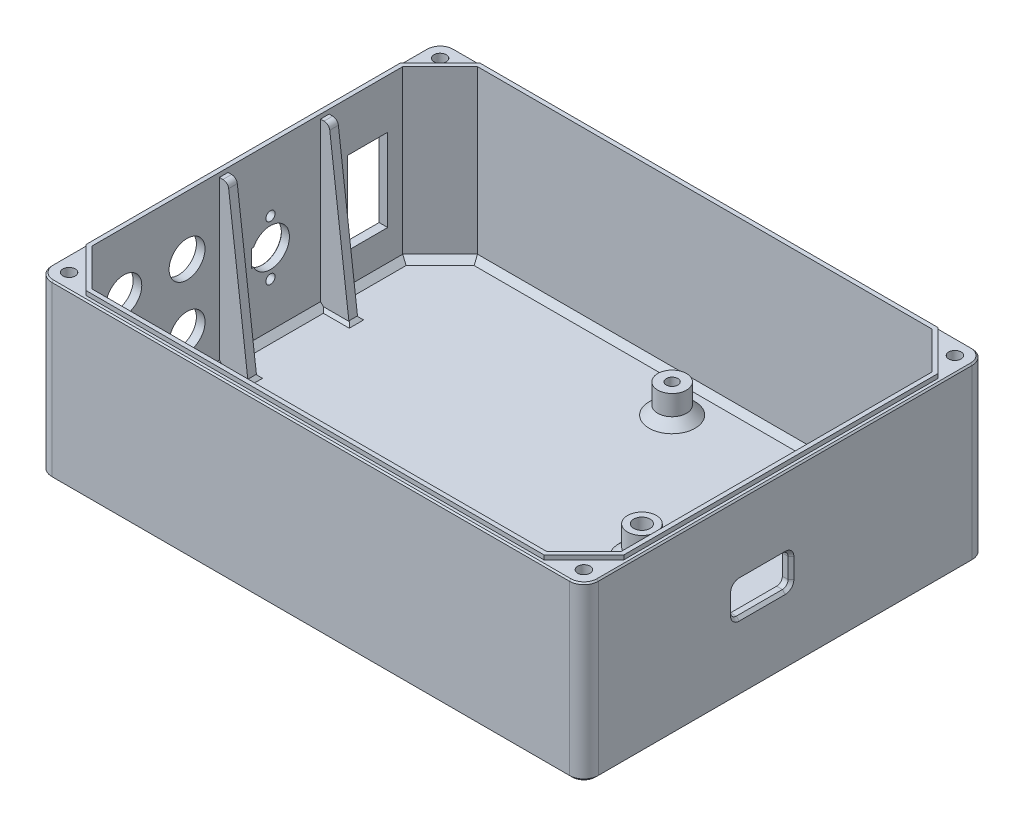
from build123d import *
from OCP.BRepFilletAPI import BRepFilletAPI_MakeChamfer

# Parameters (mm, degrees)
SKETCH2_W                      = 190
SKETCH2_H                      = 140
ENCLOSURE_BODY_DEPTH           = 60
FILLET1_R                      = 5
SHELL1_T                       = -3
SKETCH3_R                      = 5
SKETCH3_R_2                    = 2
SKETCH3_R_3                    = 2.85
PCB_SUPPORTS_DEPTH             = 10
ENCLOSURE_START                = 57
ENCLOSURE_CORNER_FLANGES_DEPTH = 57
SKETCH8_R                      = 3.8
CUT_EXTRUDE1_DEPTH             = 45.5
SKETCH9_R                      = 2.15
CUT_EXTRUDE2_DEPTH             = 127.472328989
CHAMFER1_SIZE                  = 2
USB_CUTOUT_DEPTH               = 6
SKETCH11_R                     = 1.6
SKETCH11_R_2                   = 6.25
SKETCH11_W                     = 14
SKETCH11_H                     = 28.7
BUTTON_CUTOUTS_DEPTH           = 6
CHAMFER3_SIZE                  = 1
SKETCH15_W                     = 3
SKETCH15_H                     = 12.65913529
SKETCH15_H_2                   = 57
BOSS_EXTRUDE6_DEPTH            = 10
CUT_EXTRUDE3_REACH             = 155.152
CHAMFER4_SIZE                  = 3
FILLET2_R                      = 2
BOSS_EXTRUDE7_DEPTH            = 1.5
CHAMFER5_SIZE                  = 1
CHAMFER5_SIZE2                 = 1.148564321
CHAMFER6_SIZE                  = 1
CHAMFER7_SIZE                  = 0.2
CHAMFER8_SIZE                  = 0.5


with BuildPart() as part:
    # Sketch2 → Enclosure body (new body)
    with BuildSketch(Plane(origin=(0, 0, 0), x_dir=(1, 0, 0), z_dir=(0, 1, 0))):
        Rectangle(SKETCH2_W, SKETCH2_H)
    extrude(amount=ENCLOSURE_BODY_DEPTH)

    # Fillet1
    fillet1_edges = [part.edges().sort_by_distance(p)[0] for p in [
        (95, 30, 70),
        (-95, 30, 70),
        (-95, 30, -70),
        (95, 30, -70),
    ]]
    fillet(fillet1_edges, radius=FILLET1_R)

    # Shell1
    shell1_openings = [part.faces().sort_by_distance(p)[0] for p in [
        (0, 60, 0),
    ]]
    offset(amount=SHELL1_T, openings=shell1_openings, kind=Kind.INTERSECTION)

    # Sketch3 → PCB Supports (add)
    # profile 1 of 5: a face of its own
    with BuildSketch(Plane(origin=(0, 3, 0), x_dir=(1, 0, 0), z_dir=(0, 1, 0))):
        with Locations(Location((1.270356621, 54.416611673, 0), (0, 0, 270))):
            Circle(SKETCH3_R)
        with Locations(Location((1.270356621, 54.416611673, 0), (0, 0, 270))):
            Circle(SKETCH3_R_2, mode=Mode.SUBTRACT)
    # profile 2 of 5: a face of its own
    with BuildSketch(Plane(origin=(0, 3, 0), x_dir=(1, 0, 0), z_dir=(0, 1, 0))):
        with Locations(Location((76.270356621, 54.416611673, 0), (0, 0, 270))):
            Circle(SKETCH3_R)
        with Locations(Location((76.270356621, 54.416611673, 0), (0, 0, 270))):
            Circle(SKETCH3_R_2, mode=Mode.SUBTRACT)
    # profile 3 of 5: a face of its own
    with BuildSketch(Plane(origin=(0, 3, 0), x_dir=(1, 0, 0), z_dir=(0, 1, 0))):
        with Locations(Location((76.270356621, -55.583388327, 0), (0, 0, 270))):
            Circle(SKETCH3_R)
        with Locations(Location((76.270356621, -55.583388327, 0), (0, 0, 270))):
            Circle(SKETCH3_R_2, mode=Mode.SUBTRACT)
    # profile 4 of 5: a face of its own
    with BuildSketch(Plane(origin=(0, 3, 0), x_dir=(1, 0, 0), z_dir=(0, 1, 0))):
        with Locations(Location((1.270356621, -55.583388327, 0), (0, 0, 270))):
            Circle(SKETCH3_R)
        with Locations(Location((1.270356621, -55.583388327, 0), (0, 0, 270))):
            Circle(SKETCH3_R_2, mode=Mode.SUBTRACT)
    # profile 5 of 5: a face of its own
    with BuildSketch(Plane(origin=(0, 3, 0), x_dir=(1, 0, 0), z_dir=(0, 1, 0))):
        with Locations(Location((38.770356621, 6.416611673, 0), (0, 0, 270))):
            Circle(SKETCH3_R)
        with Locations(Location((38.770356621, 6.416611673, 0), (0, 0, 270))):
            Circle(SKETCH3_R_3, mode=Mode.SUBTRACT)
    extrude(amount=PCB_SUPPORTS_DEPTH)

    # Sketch6 → Enclosure corner flanges (add)
    with BuildSketch(Plane(origin=(0, 3, 0), x_dir=(1, 0, 0), z_dir=(0, 1, 0)).offset(ENCLOSURE_START)):
        with BuildLine():
            Line((-79, 67), (-92, 54))
            Line((-92, 54), (-92, 65))
            ThreePointArc((-92, 65), (-91.414213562, 66.414213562), (-90, 67))
            Line((-90, 67), (-79, 67))
        make_face()
        with BuildLine():
            Line((-92, -54), (-79, -67))
            Line((-79, -67), (-90, -67))
            ThreePointArc((-90, -67), (-91.414213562, -66.414213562), (-92, -65))
            Line((-92, -65), (-92, -54))
        make_face()
        with BuildLine():
            Line((79, -67), (92, -54))
            Line((92, -54), (92, -65))
            ThreePointArc((92, -65), (91.414213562, -66.414213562), (90, -67))
            Line((90, -67), (79, -67))
        make_face()
        with BuildLine():
            Line((79, 67), (92, 54))
            Line((92, 54), (92, 65))
            ThreePointArc((92, 65), (91.414213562, 66.414213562), (90, 67))
            Line((90, 67), (79, 67))
        make_face()
    extrude(amount=-ENCLOSURE_CORNER_FLANGES_DEPTH)

    # Sketch8 → Cut-Extrude1 (cut)
    with BuildSketch(Plane.XZ):
        with Locations(Location((89.517766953, -64.517766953, 0), (0, 0, 270))):
            Circle(SKETCH8_R)
        with Locations(Location((89.517766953, 64.517766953, 0), (0, 0, 270))):
            Circle(SKETCH8_R)
        with Locations(Location((-89.517766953, 64.517766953, 0), (0, 0, 270))):
            Circle(SKETCH8_R)
        with Locations(Location((-89.517766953, -64.517766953, 0), (0, 0, 270))):
            Circle(SKETCH8_R)
    extrude(amount=-CUT_EXTRUDE1_DEPTH, mode=Mode.SUBTRACT)

    # Sketch9 → Cut-Extrude2 (cut, through all)
    with BuildSketch(Plane.XZ.offset(-45.5)):
        with Locations(Location((-89.517766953, 64.517766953, 0), (0, 0, 270))):
            Circle(SKETCH9_R)
        with Locations(Location((89.517766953, 64.517766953, 0), (0, 0, 270))):
            Circle(SKETCH9_R)
        with Locations(Location((89.517766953, -64.517766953, 0), (0, 0, 270))):
            Circle(SKETCH9_R)
        with Locations(Location((-89.517766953, -64.517766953, 0), (0, 0, 270))):
            Circle(SKETCH9_R)
    extrude(amount=-CUT_EXTRUDE2_DEPTH, mode=Mode.SUBTRACT)

    # Chamfer1
    chamfer1_edges = [part.edges().sort_by_distance(p)[0] for p in [
        (0, 3, 67),
        (92, 3, 0),
        (0, 3, -67),
        (-92, 3, 0),
        (-85.5, 3, 60.5),
        (85.5, 3, -60.5),
        (-85.5, 3, -60.5),
        (85.5, 3, 60.5),
    ]]
    chamfer(chamfer1_edges, length=CHAMFER1_SIZE)

    # Sketch10 → USB cutout (cut)
    with BuildSketch(Plane(origin=(95, 0, -30), x_dir=(0, 0, 1), z_dir=(-1, 0, 0))):
        with BuildLine():
            Line((29.983133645, 35), (45.983133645, 35))
            ThreePointArc((45.983133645, 35), (47.397347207, 34.414213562), (47.983133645, 33))
            Line((47.983133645, 33), (47.983133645, 26))
            ThreePointArc((47.983133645, 26), (47.397347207, 24.585786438), (45.983133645, 24))
            Line((45.983133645, 24), (29.983133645, 24))
            ThreePointArc((29.983133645, 24), (28.568920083, 24.585786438), (27.983133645, 26))
            Line((27.983133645, 26), (27.983133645, 33))
            ThreePointArc((27.983133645, 33), (28.568920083, 34.414213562), (29.983133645, 35))
        make_face()
    extrude(amount=USB_CUTOUT_DEPTH, mode=Mode.SUBTRACT)

    # Sketch11 → Button cutouts (cut)
    with BuildSketch(Plane.ZY.offset(95)):
        with Locations((-8, 39.5)):
            Circle(SKETCH11_R)
        with Locations((-8, 20.5)):
            Circle(SKETCH11_R)
        with Locations((21, 41)):
            Circle(SKETCH11_R_2)
        with Locations((21, 19)):
            Circle(SKETCH11_R_2)
        with Locations((43, 19)):
            Circle(SKETCH11_R_2)
        with Locations((43, 41)):
            Circle(SKETCH11_R_2)
        with BuildLine():
            Line((-2.121224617, 33), (-1.4, 33))
            Line((-1.4, 33), (-1.4, 27))
            Line((-1.4, 27), (-2.121224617, 27))
            ThreePointArc((-2.121224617, 27), (-14.6, 30), (-2.121224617, 33))
        make_face()
        with Locations((-41.773709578, 30)):
            Rectangle(SKETCH11_W, SKETCH11_H)
    extrude(amount=-BUTTON_CUTOUTS_DEPTH, mode=Mode.SUBTRACT)

    # Chamfer3
    chamfer3_edges = [part.edges().sort_by_distance(p)[0] for p in [
        (0, 0, 70),
        (95, 0, 0),
        (-95, 0, 0),
        (0, 0, -70),
        (93.535533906, 0, 68.535533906),
        (93.535533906, 0, -68.535533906),
        (-93.535533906, 0, -68.535533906),
        (-93.535533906, 0, 68.535533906),
    ]]
    chamfer(chamfer3_edges, length=CHAMFER3_SIZE)

    # Sketch15 → Boss-Extrude6 (add)
    with BuildSketch(Plane(origin=(-92, 0, 0), x_dir=(0, 0, -1), z_dir=(1, 0, 0))):
        with Locations((-32.569436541, 9.329567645)):
            Rectangle(SKETCH15_W, SKETCH15_H)
        with Locations((26.908015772, 31.5)):
            Rectangle(SKETCH15_W, SKETCH15_H_2)
        with Locations((-8.246855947, 31.5)):
            Rectangle(SKETCH15_W, SKETCH15_H_2)
    extrude(amount=BOSS_EXTRUDE6_DEPTH)

    # Cut-Extrude3: up to this face of the body (flat: up to its plane)
    cut_extrude3_end = Plane(part.part.faces().sort_by_distance((-86.984741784, 31.598004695, -28.408015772))[0])
    # Sketch16 → Cut-Extrude3 (cut, up to the picked face)
    with BuildSketch(Plane.XY.offset(34.069436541), mode=Mode.PRIVATE) as cut_extrude3_sk1:
        Polygon((-82, 60), (-82, 3), (-89, 60), align=None)
    cut_extrude3_tool1 = split(extrude(cut_extrude3_sk1.sketch, amount=-CUT_EXTRUDE3_REACH, mode=Mode.PRIVATE), bisect_by=cut_extrude3_end, keep=Keep.BOTH, mode=Mode.PRIVATE)
    add(cut_extrude3_tool1.solids().sort_by(Axis((-84.333333, 41, 34.069437), (0, 0, -1)))[0], mode=Mode.SUBTRACT)

    # Chamfer4
    chamfer4_edges = [part.edges().sort_by_distance(p)[0] for p in [
        (1.270356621, 3, 50.583388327),
        (76.270356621, 3, 50.583388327),
        (76.270356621, 3, -59.416611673),
        (1.270356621, 3, -59.416611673),
        (38.770356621, 3, -11.416611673),
    ]]
    chamfer(chamfer4_edges, length=CHAMFER4_SIZE)

    # Fillet2
    fillet2_edges = [part.edges().sort_by_distance(p)[0] for p in [
        (-89, 60, 8.246855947),
        (-89, 60, -26.908015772),
        (-83.55463065, 15.65913529, 32.569436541),
    ]]
    fillet(fillet2_edges, radius=FILLET2_R)

    # Sketch17 → Boss-Extrude7 (add)
    with BuildSketch(Plane(origin=(0, 60, 0), x_dir=(1, 0, 0), z_dir=(0, 1, 0))):
        Polygon((-93.5, 54.621320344), (-93.5, -54.621320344), (-79.621320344, -68.5), (79.621320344, -68.5), (93.5, -54.621320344), (93.5, 54.621320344), (79.621320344, 68.5), (-79.621320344, 68.5), align=None)
        Polygon((79, 67), (92, 54), (92, -54), (79, -67), (-79, -67), (-92, -54), (-92, 54), (-79, 67), align=None, mode=Mode.SUBTRACT)
    extrude(amount=BOSS_EXTRUDE7_DEPTH)

    # Chamfer5: one chamfer whose edges measure the first distance from different faces: ONE call of the kernel's chamfer builder (chamfer() names one face for all edges)
    chamfer5_edges_1 = [part.edges().sort_by_distance(p)[0] for p in [
        (-86, 3, 34.069436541),
        (-86, 3, 31.069436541),
        (-86, 3, -25.408015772),
        (-86, 3, -28.408015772),
        (-86, 3, 9.746855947),
        (-86, 3, 6.746855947),
    ]]
    chamfer5_edges_2 = [part.edges().sort_by_distance(p)[0] for p in [
        (-82, 3, 32.569436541),
        (-82, 3, -26.908015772),
        (-82, 3, 8.246855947),
    ]]
    chamfer5_side_2 = [part.faces().sort_by_distance(p)[0] for p in [
        (-1.487293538, 3, 0.022100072),
    ]]
    chamfer5 = BRepFilletAPI_MakeChamfer(part.part.solid().wrapped)
    for e in chamfer5_edges_1:
        chamfer5.Add(CHAMFER5_SIZE, e.wrapped)
    for e in chamfer5_edges_2:
        chamfer5.Add(CHAMFER5_SIZE, CHAMFER5_SIZE2, e.wrapped, chamfer5_side_2[0].wrapped)  # the first distance lies on this face
    add(Compound.cast(chamfer5.Shape()), mode=Mode.REPLACE)

    # Chamfer6
    chamfer6_edges = [part.edges().sort_by_distance(p)[0] for p in [
        (95, 34.414213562, 17.397347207),
        (95, 35, 7.983133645),
        (95, 34.414213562, -1.431079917),
        (95, 29.5, -2.016866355),
        (95, 24.585786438, -1.431079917),
        (95, 24, 7.983133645),
        (95, 24.585786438, 17.397347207),
        (95, 29.5, 17.983133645),
    ]]
    chamfer(chamfer6_edges, length=CHAMFER6_SIZE)

    # Chamfer7
    chamfer7_edges = [part.edges().sort_by_distance(p)[0] for p in [
        (-95, 30, -14.6),
    ]]
    chamfer(chamfer7_edges, length=CHAMFER7_SIZE)

    # Chamfer8
    chamfer8_edges = [part.edges().sort_by_distance(p)[0] for p in [
        (0, 60, 70),
        (-95, 60, 0),
        (95, 60, 0),
        (0, 60, -70),
        (93.535533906, 60, 68.535533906),
        (93.535533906, 60, -68.535533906),
        (-93.535533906, 60, -68.535533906),
        (-93.535533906, 60, 68.535533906),
    ]]
    chamfer(chamfer8_edges, length=CHAMFER8_SIZE)


solid = part.part
